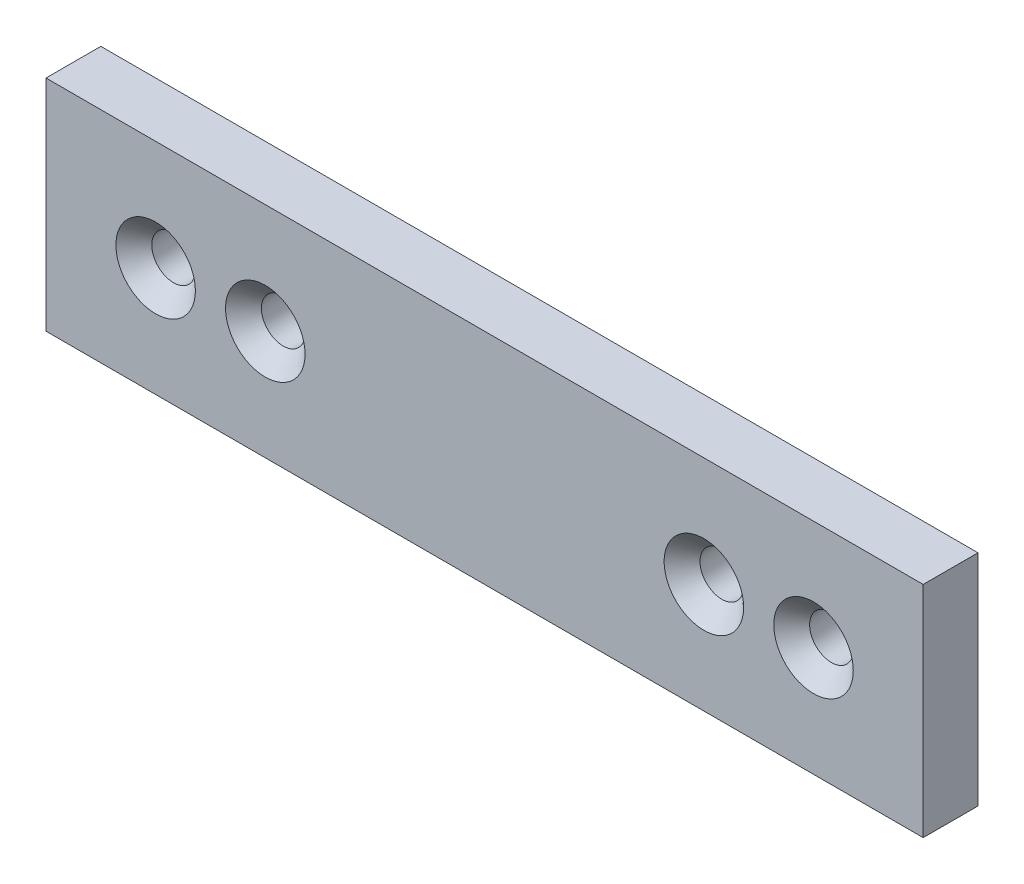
from build123d import *

# Parameters (mm, degrees)
SKETCH1_W                            = 101.6
SKETCH1_H                            = 25.4
BOSS_EXTRUDE1_DEPTH                  = 6.35
F_8_0_199_DIAMETER_HOLE1_D           = 5.0546
F_8_0_199_DIAMETER_HOLE1_CSINK_D     = 9.2075
F_8_0_199_DIAMETER_HOLE1_CSINK_ANGLE = 90


with BuildPart() as part:
    # Sketch1 → Boss-Extrude1 (new body)
    with BuildSketch(Plane.XY):
        with Locations((-22.568096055, 4.727101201)):
            Rectangle(SKETCH1_W, SKETCH1_H)
    extrude(amount=BOSS_EXTRUDE1_DEPTH)

    # 8 _0.199_ Diameter Hole1 (through all)
    with Locations(Plane.XY.offset(6.35)):
        with Locations((-60.668096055, 4.727101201), (-47.968096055, 4.727101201), (2.831903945, 4.727101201), (15.531903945, 4.727101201)):
            CounterSinkHole(F_8_0_199_DIAMETER_HOLE1_D / 2, F_8_0_199_DIAMETER_HOLE1_CSINK_D / 2, counter_sink_angle=F_8_0_199_DIAMETER_HOLE1_CSINK_ANGLE)


solid = part.part
